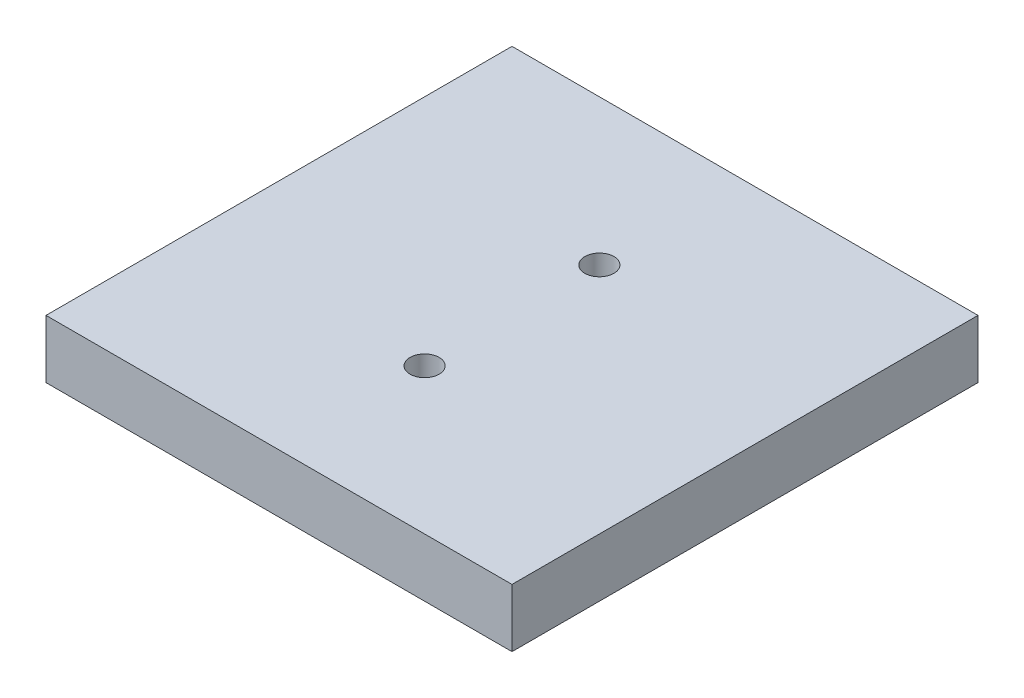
from build123d import *

# Parameters (mm, degrees)
ESQUISSE1_W       = 80
ESQUISSE1_H       = 10
EXTRUSION1_DEPTH  = 80
TROU_TARAUD_M61_D = 5


with BuildPart() as part:
    # Esquisse1 → Extrusion1 (new body)
    with BuildSketch(Plane.XY):
        with Locations((40, 5)):
            Rectangle(ESQUISSE1_W, ESQUISSE1_H)
    extrude(amount=EXTRUSION1_DEPTH)

    # Trou taraud_ M61 (through all)
    with Locations(Plane(origin=(0, 10, 0), x_dir=(-1, 0, 0), z_dir=(0, 1, 0))):
        with Locations((-40, 25), (-40, 55)):
            Hole(TROU_TARAUD_M61_D / 2)


solid = part.part
